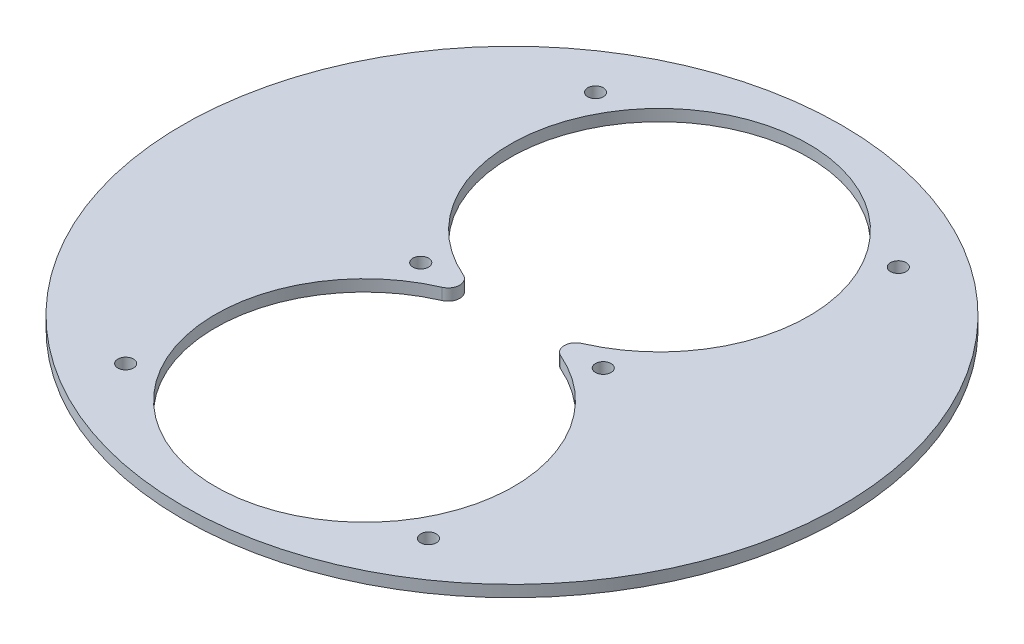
from build123d import *

# Parameters (mm, degrees)
SKETCH1_R                = 90.4875
BOSS_EXTRUDE1_DEPTH      = 3.175
M4_CLEARANCE_HOLE2_D     = 4.3
M4_CLEARANCE_HOLE2_DEPTH = 7.499985
M4_CLEARANCE_HOLE2_TIP   = 1.291850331


with BuildPart() as part:
    # Sketch1 → Boss-Extrude1 (new body)
    with BuildSketch(Plane(origin=(0, 0, 0), x_dir=(1, 0, 0), z_dir=(0, 1, 0))):
        with Locations(Location((0, 0, 0), (0, 0, 270))):
            Circle(SKETCH1_R)
        with BuildLine():
            ThreePointArc((16.272201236, 2.913669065), (0, 81.4575), (-16.272201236, 2.913669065))
            ThreePointArc((-16.272201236, 2.913669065), (-14.358612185, 0), (-16.272201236, -2.913669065))
            ThreePointArc((-16.272201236, -2.913669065), (0, -81.4575), (16.272201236, -2.913669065))
            ThreePointArc((16.272201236, -2.913669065), (14.358612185, 0), (16.272201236, 2.913669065))
        make_face(mode=Mode.SUBTRACT)
    extrude(amount=BOSS_EXTRUDE1_DEPTH)

    # M4 Clearance Hole2
    with Locations(Plane(origin=(0, 0, 0), x_dir=(-1, 0, 0), z_dir=(0, -1, 0))):
        with Locations((-25.057745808, 0), (25.057745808, 0), (41.569219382, -64.5), (-41.569219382, -64.5), (-41.569219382, 64.5), (41.569219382, 64.5)):
            Hole(M4_CLEARANCE_HOLE2_D / 2, depth=M4_CLEARANCE_HOLE2_DEPTH)
            with Locations((0, 0, -(M4_CLEARANCE_HOLE2_DEPTH + M4_CLEARANCE_HOLE2_TIP / 2))):  # 118° drill point
                Cone(0, M4_CLEARANCE_HOLE2_D / 2, M4_CLEARANCE_HOLE2_TIP, mode=Mode.SUBTRACT)


solid = part.part
